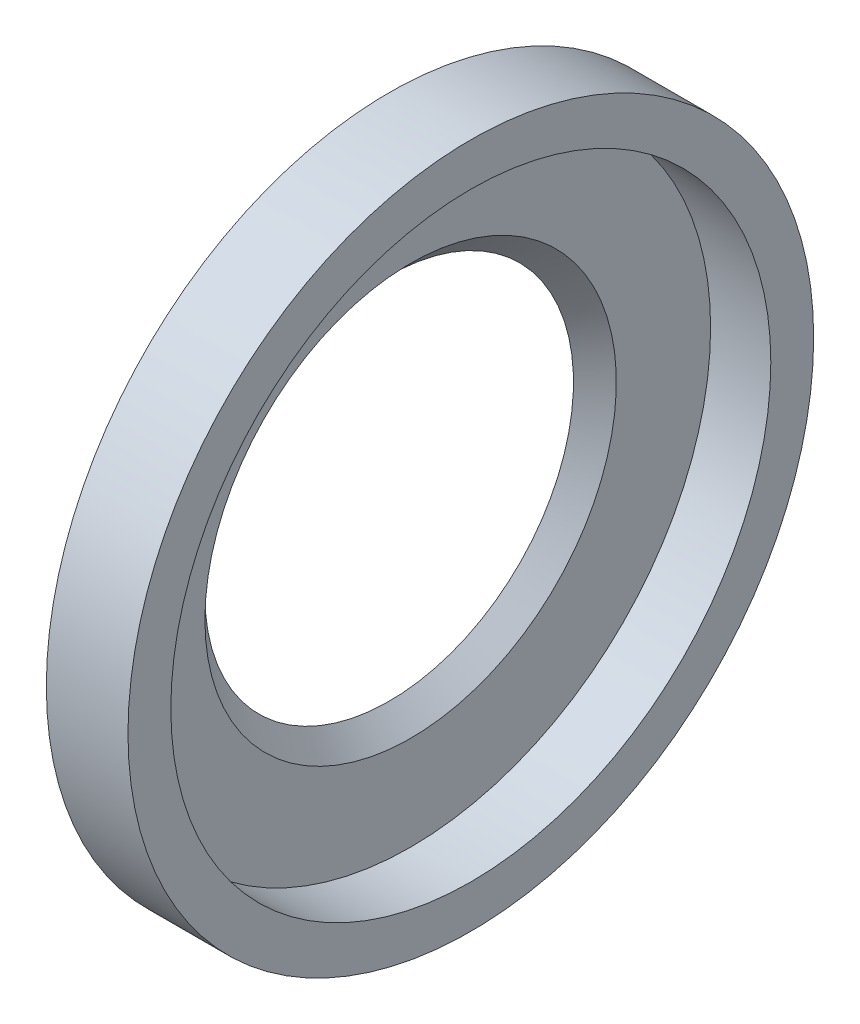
ISO-10303-21;
HEADER;
FILE_DESCRIPTION(('STEP AP214'),'2;1');
FILE_NAME('part.step','',(''),(''),'','','');
FILE_SCHEMA(('AUTOMOTIVE_DESIGN { 1 0 10303 214 1 1 1 1 }'));
ENDSEC;
DATA;
#1=APPLICATION_CONTEXT('core data for automotive mechanical design processes');
#2=APPLICATION_PROTOCOL_DEFINITION('international standard','automotive_design',2000,#1);
#3=PRODUCT_CONTEXT('',#1,'mechanical');
#4=PRODUCT('Part','Part','',(#3));
#5=PRODUCT_RELATED_PRODUCT_CATEGORY('part','',(#4));
#6=PRODUCT_DEFINITION_FORMATION('','',#4);
#7=PRODUCT_DEFINITION_CONTEXT('part definition',#1,'design');
#8=PRODUCT_DEFINITION('design','',#6,#7);
#9=PRODUCT_DEFINITION_SHAPE('','',#8);
#10=(LENGTH_UNIT() NAMED_UNIT(*) SI_UNIT(.MILLI.,.METRE.));
#11=(NAMED_UNIT(*) PLANE_ANGLE_UNIT() SI_UNIT($,.RADIAN.));
#12=(NAMED_UNIT(*) SI_UNIT($,.STERADIAN.) SOLID_ANGLE_UNIT());
#13=UNCERTAINTY_MEASURE_WITH_UNIT(LENGTH_MEASURE(1.E-05),#10,'distance_accuracy_value','');
#14=(GEOMETRIC_REPRESENTATION_CONTEXT(3) GLOBAL_UNCERTAINTY_ASSIGNED_CONTEXT((#13)) GLOBAL_UNIT_ASSIGNED_CONTEXT((#10,
#11,#12)) REPRESENTATION_CONTEXT('',''));
#15=CARTESIAN_POINT('',(0.,0.,0.));
#16=DIRECTION('',(0.,0.,1.));
#17=DIRECTION('',(1.,0.,0.));
#18=AXIS2_PLACEMENT_3D('',#15,#16,#17);
#19=CARTESIAN_POINT('',(0.,0.,0.));
#20=DIRECTION('',(1.,0.,0.));
#21=DIRECTION('',(0.,0.,-1.));
#22=AXIS2_PLACEMENT_3D('',#19,#20,#21);
#23=CONICAL_SURFACE('',#22,6.8267,0.785398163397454);
#24=CARTESIAN_POINT('',(0.79375,0.,0.));
#25=DIRECTION('',(-1.,0.,0.));
#26=DIRECTION('',(0.,0.,1.));
#27=AXIS2_PLACEMENT_3D('',#24,#25,#26);
#28=CIRCLE('',#27,7.62045000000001);
#29=CARTESIAN_POINT('',(0.79375,0.,7.62045000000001));
#30=VERTEX_POINT('',#29);
#31=EDGE_CURVE('E52',#30,#30,#28,.T.);
#32=ORIENTED_EDGE('',*,*,#31,.F.);
#33=EDGE_LOOP('',(#32));
#34=FACE_BOUND('',#33,.T.);
#35=CARTESIAN_POINT('',(0.,0.,0.));
#36=DIRECTION('',(-1.,0.,0.));
#37=DIRECTION('',(0.,0.,1.));
#38=AXIS2_PLACEMENT_3D('',#35,#36,#37);
#39=CIRCLE('',#38,6.8267);
#40=CARTESIAN_POINT('',(0.,0.,6.8267));
#41=VERTEX_POINT('',#40);
#42=EDGE_CURVE('E10',#41,#41,#39,.T.);
#43=ORIENTED_EDGE('',*,*,#42,.T.);
#44=EDGE_LOOP('',(#43));
#45=FACE_BOUND('',#44,.T.);
#46=ADVANCED_FACE('F30',(#34,#45),#23,.F.);
#47=CARTESIAN_POINT('',(0.,6.8267,0.));
#48=DIRECTION('',(1.,0.,0.));
#49=DIRECTION('',(0.,0.,-1.));
#50=AXIS2_PLACEMENT_3D('',#47,#48,#49);
#51=PLANE('',#50);
#52=ORIENTED_EDGE('',*,*,#42,.F.);
#53=EDGE_LOOP('',(#52));
#54=FACE_BOUND('',#53,.T.);
#55=CARTESIAN_POINT('',(0.,0.,0.));
#56=DIRECTION('',(-1.,0.,0.));
#57=DIRECTION('',(0.,0.,1.));
#58=AXIS2_PLACEMENT_3D('',#55,#56,#57);
#59=CIRCLE('',#58,12.7);
#60=CARTESIAN_POINT('',(0.,0.,12.7));
#61=VERTEX_POINT('',#60);
#62=EDGE_CURVE('E36',#61,#61,#59,.T.);
#63=ORIENTED_EDGE('',*,*,#62,.T.);
#64=EDGE_LOOP('',(#63));
#65=FACE_BOUND('',#64,.T.);
#66=ADVANCED_FACE('F59',(#54,#65),#51,.F.);
#67=CARTESIAN_POINT('',(0.,0.,0.));
#68=DIRECTION('',(-1.,0.,0.));
#69=DIRECTION('',(0.,0.,1.));
#70=AXIS2_PLACEMENT_3D('',#67,#68,#69);
#71=CYLINDRICAL_SURFACE('',#70,12.7);
#72=ORIENTED_EDGE('',*,*,#62,.F.);
#73=EDGE_LOOP('',(#72));
#74=FACE_BOUND('',#73,.T.);
#75=CARTESIAN_POINT('',(3.0239,0.,0.));
#76=DIRECTION('',(-1.,0.,0.));
#77=DIRECTION('',(0.,0.,1.));
#78=AXIS2_PLACEMENT_3D('',#75,#76,#77);
#79=CIRCLE('',#78,12.7);
#80=CARTESIAN_POINT('',(3.0239,0.,12.7));
#81=VERTEX_POINT('',#80);
#82=EDGE_CURVE('E40',#81,#81,#79,.T.);
#83=ORIENTED_EDGE('',*,*,#82,.T.);
#84=EDGE_LOOP('',(#83));
#85=FACE_BOUND('',#84,.T.);
#86=ADVANCED_FACE('F63',(#74,#85),#71,.T.);
#87=CARTESIAN_POINT('',(3.0239,12.7,0.));
#88=DIRECTION('',(-1.,0.,0.));
#89=DIRECTION('',(0.,0.,1.));
#90=AXIS2_PLACEMENT_3D('',#87,#88,#89);
#91=PLANE('',#90);
#92=ORIENTED_EDGE('',*,*,#82,.F.);
#93=EDGE_LOOP('',(#92));
#94=FACE_BOUND('',#93,.T.);
#95=CARTESIAN_POINT('',(3.0239,0.,0.));
#96=DIRECTION('',(-1.,0.,0.));
#97=DIRECTION('',(0.,0.,1.));
#98=AXIS2_PLACEMENT_3D('',#95,#96,#97);
#99=CIRCLE('',#98,11.1125);
#100=CARTESIAN_POINT('',(3.0239,0.,11.1125));
#101=VERTEX_POINT('',#100);
#102=EDGE_CURVE('E44',#101,#101,#99,.T.);
#103=ORIENTED_EDGE('',*,*,#102,.T.);
#104=EDGE_LOOP('',(#103));
#105=FACE_BOUND('',#104,.T.);
#106=ADVANCED_FACE('F68',(#94,#105),#91,.F.);
#107=CARTESIAN_POINT('',(0.,0.,0.));
#108=DIRECTION('',(-1.,0.,0.));
#109=DIRECTION('',(0.,0.,1.));
#110=AXIS2_PLACEMENT_3D('',#107,#108,#109);
#111=CYLINDRICAL_SURFACE('',#110,11.1125);
#112=ORIENTED_EDGE('',*,*,#102,.F.);
#113=EDGE_LOOP('',(#112));
#114=FACE_BOUND('',#113,.T.);
#115=CARTESIAN_POINT('',(0.79375,0.,0.));
#116=DIRECTION('',(-1.,0.,0.));
#117=DIRECTION('',(0.,0.,1.));
#118=AXIS2_PLACEMENT_3D('',#115,#116,#117);
#119=CIRCLE('',#118,11.1125);
#120=CARTESIAN_POINT('',(0.79375,0.,11.1125));
#121=VERTEX_POINT('',#120);
#122=EDGE_CURVE('E49',#121,#121,#119,.T.);
#123=ORIENTED_EDGE('',*,*,#122,.T.);
#124=EDGE_LOOP('',(#123));
#125=FACE_BOUND('',#124,.T.);
#126=ADVANCED_FACE('F74',(#114,#125),#111,.F.);
#127=CARTESIAN_POINT('',(0.79375,11.1125,0.));
#128=DIRECTION('',(-1.,0.,0.));
#129=DIRECTION('',(0.,0.,1.));
#130=AXIS2_PLACEMENT_3D('',#127,#128,#129);
#131=PLANE('',#130);
#132=ORIENTED_EDGE('',*,*,#122,.F.);
#133=EDGE_LOOP('',(#132));
#134=FACE_BOUND('',#133,.T.);
#135=ORIENTED_EDGE('',*,*,#31,.T.);
#136=EDGE_LOOP('',(#135));
#137=FACE_BOUND('',#136,.T.);
#138=ADVANCED_FACE('F56',(#134,#137),#131,.F.);
#139=CLOSED_SHELL('',(#46,#66,#86,#106,#126,#138));
#140=MANIFOLD_SOLID_BREP('B2',#139);
#141=ADVANCED_BREP_SHAPE_REPRESENTATION('',(#18,#140),#14);
#142=SHAPE_DEFINITION_REPRESENTATION(#9,#141);
ENDSEC;
END-ISO-10303-21;
